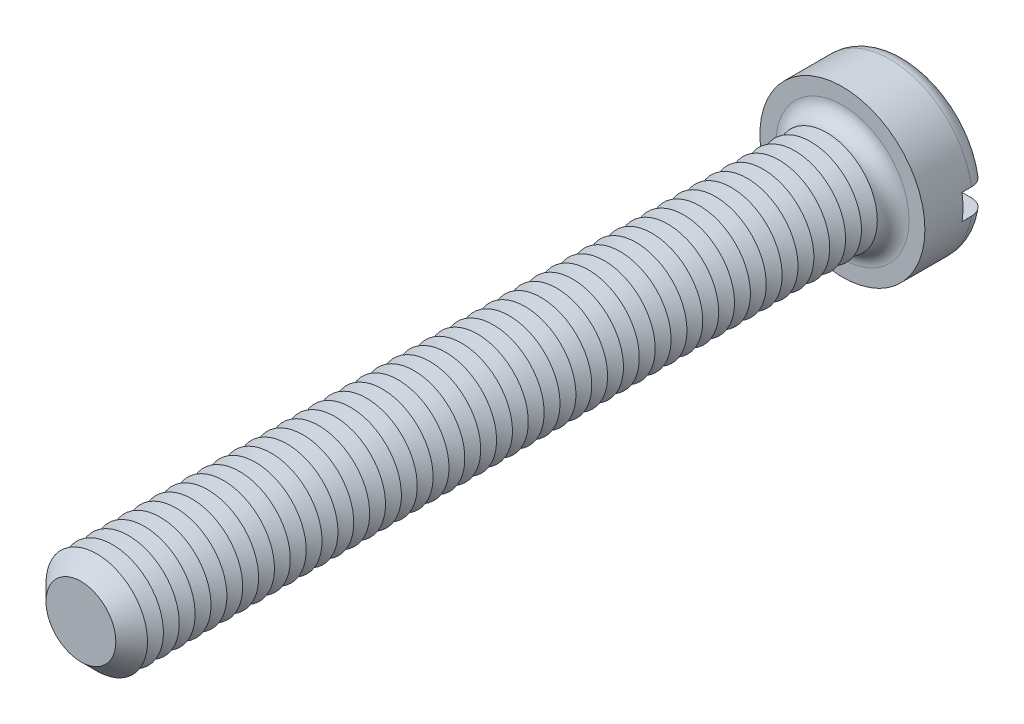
from build123d import *

# Parameters (mm, degrees)
SKETCH3_R           = 6.5
BOSS_EXTRUDE2_DEPTH = 5
SKETCH4_R           = 4
BOSS_EXTRUDE3_DEPTH = 60
FILLET1_R           = 1.25
CHAMFER1_SIZE       = 1.25
LPATTERN1_COUNT     = 46
LPATTERN1_PITCH     = 1.25
SKETCH8_W           = 13
SKETCH8_H           = 2
CUT_EXTRUDE1_DEPTH  = 2


with BuildPart() as part:
    # Sketch3 → Boss-Extrude2 (new body)
    with BuildSketch(Plane.XY):
        Circle(SKETCH3_R)
    extrude(amount=-BOSS_EXTRUDE2_DEPTH)

    # Sketch4 → Boss-Extrude3 (add)
    with BuildSketch(Plane.XY):
        Circle(SKETCH4_R)
    extrude(amount=BOSS_EXTRUDE3_DEPTH)

    # Fillet1
    fillet1_edges = [part.edges().sort_by_distance(p)[0] for p in [
        (-6.5, 0, -5),
        (-4, 0, 0),
    ]]
    fillet(fillet1_edges, radius=FILLET1_R)

    # Chamfer1
    chamfer1_edges = [part.edges().sort_by_distance(p)[0] for p in [
        (-4, 0, 60),
    ]]
    chamfer(chamfer1_edges, length=CHAMFER1_SIZE)

    # Sketch6 → Cut-Revolve1 (revolve, cut)
    with BuildSketch(Plane(origin=(0, 0, 0), x_dir=(0, 0, -1), z_dir=(1, 0, 0)), mode=Mode.PRIVATE) as cut_revolve1_sk:
        Polygon((-1.25, 4), (-1.875, 2.917468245), (-2.5, 4), align=None)
    cut_revolve1 = revolve(cut_revolve1_sk.sketch.rotate(Axis((0, 0, -1.694361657), (0, 0, 1)), 90), axis=Axis((0, 0, -1.694361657), (0, 0, 1)), mode=Mode.SUBTRACT)

    # LPattern1: Cut-Revolve1 ×46
    with Locations(*[(0, 0, i * LPATTERN1_PITCH) for i in range(1, LPATTERN1_COUNT)]):
        add(cut_revolve1, mode=Mode.SUBTRACT)

    # Sketch8 → Cut-Extrude1 (cut)
    with BuildSketch(Plane(origin=(0, 0, -5), x_dir=(-1, 0, 0), z_dir=(0, 0, -1))):
        Rectangle(SKETCH8_W, SKETCH8_H)
    extrude(amount=-CUT_EXTRUDE1_DEPTH, mode=Mode.SUBTRACT)


solid = part.part
